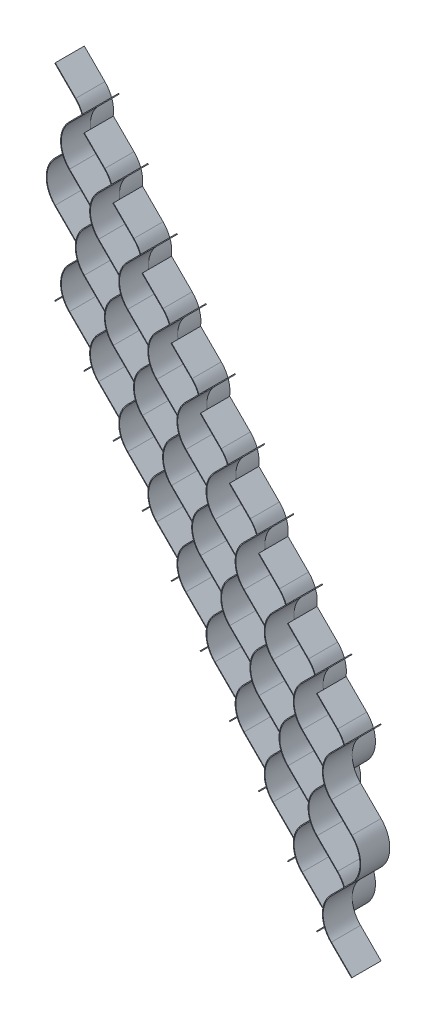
from build123d import *

# Parameters (mm, degrees)
LINEAR_AUSTRAGEN_D_NN1_DEPTH = 10
LINEAR_AUSTRAGEN_D_NN2_START = -2
LINEAR_AUSTRAGEN_D_NN2_DEPTH = 10
LINEARES_MUSTER2_COUNT       = 10
LINEARES_MUSTER2_PITCH       = 30.35


with BuildPart() as part:
    # Skizze3 → Linear-Austragen-D_nn1 (new body)
    with BuildSketch(Plane.XY):
        with BuildLine():
            Line((0, 0), (7.071067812, 7.071067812))
            ThreePointArc((7.071067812, 7.071067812), (10, 14.142135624), (7.071067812, 21.213203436))
            Line((7.071067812, 21.213203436), (0, 28.284271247))
            ThreePointArc((0, 28.284271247), (-2.928932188, 35.355339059), (0, 42.426406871))
            Line((0, 42.426406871), (7.071067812, 49.497474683))
            ThreePointArc((7.071067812, 49.497474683), (10, 56.568542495), (7.071067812, 63.639610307))
            Line((7.071067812, 63.639610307), (0, 70.710678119))
            Line((0, 70.710678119), (0.176776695, 70.887454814))
            Line((0.176776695, 70.887454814), (7.247844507, 63.816387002))
            ThreePointArc((7.247844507, 63.816387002), (10.25, 56.568542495), (7.247844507, 49.320697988))
            Line((7.247844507, 49.320697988), (0.176776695, 42.249630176))
            ThreePointArc((0.176776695, 42.249630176), (-2.678932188, 35.355339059), (0.176776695, 28.461047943))
            Line((0.176776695, 28.461047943), (7.247844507, 21.389980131))
            ThreePointArc((7.247844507, 21.389980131), (10.25, 14.142135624), (7.247844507, 6.894291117))
            Line((7.247844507, 6.894291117), (0.176776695, -0.176776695))
            Line((0.176776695, -0.176776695), (0, 0))
        make_face()
    extrude(amount=LINEAR_AUSTRAGEN_D_NN1_DEPTH)

    # Skizze6 → Linear-Austragen-D_nn2 (add)
    with BuildSketch(Plane.XY.offset(10).offset(LINEAR_AUSTRAGEN_D_NN2_START)):
        with BuildLine():
            Line((20, 0), (12.928932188, 7.071067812))
            ThreePointArc((12.928932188, 7.071067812), (10, 14.142135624), (12.928932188, 21.213203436))
            Line((12.928932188, 21.213203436), (20, 28.284271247))
            ThreePointArc((20, 28.284271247), (22.928932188, 35.355339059), (20, 42.426406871))
            Line((20, 42.426406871), (12.928932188, 49.497474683))
            ThreePointArc((12.928932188, 49.497474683), (10, 56.568542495), (12.928932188, 63.639610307))
            Line((12.928932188, 63.639610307), (20, 70.710678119))
            Line((20, 70.710678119), (20.176776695, 70.533901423))
            Line((20.176776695, 70.533901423), (13.105708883, 63.462833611))
            ThreePointArc((13.105708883, 63.462833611), (10.25, 56.568542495), (13.105708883, 49.674251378))
            Line((13.105708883, 49.674251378), (20.176776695, 42.603183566))
            ThreePointArc((20.176776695, 42.603183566), (23.178932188, 35.355339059), (20.176776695, 28.107494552))
            Line((20.176776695, 28.107494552), (13.105708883, 21.03642674))
            ThreePointArc((13.105708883, 21.03642674), (10.25, 14.142135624), (13.105708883, 7.247844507))
            Line((13.105708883, 7.247844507), (20.176776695, 0.176776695))
            Line((20.176776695, 0.176776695), (20, 0))
        make_face()
    extrude(amount=LINEAR_AUSTRAGEN_D_NN2_DEPTH)


with BuildPart() as lineares_muster2_1:
    # Lineares Muster2: pattern copy
    add(part.part.moved(Location(Vector(0.8524902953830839, 0, 0.5227430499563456) * (1 * LINEARES_MUSTER2_PITCH))))


with BuildPart() as lineares_muster2_2:
    # Lineares Muster2: pattern copy
    add(part.part.moved(Location(Vector(0.8524902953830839, 0, 0.5227430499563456) * (2 * LINEARES_MUSTER2_PITCH))))


with BuildPart() as lineares_muster2_3:
    # Lineares Muster2: pattern copy
    add(part.part.moved(Location(Vector(0.8524902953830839, 0, 0.5227430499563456) * (3 * LINEARES_MUSTER2_PITCH))))


with BuildPart() as lineares_muster2_4:
    # Lineares Muster2: pattern copy
    add(part.part.moved(Location(Vector(0.8524902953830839, 0, 0.5227430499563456) * (4 * LINEARES_MUSTER2_PITCH))))


with BuildPart() as lineares_muster2_5:
    # Lineares Muster2: pattern copy
    add(part.part.moved(Location(Vector(0.8524902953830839, 0, 0.5227430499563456) * (5 * LINEARES_MUSTER2_PITCH))))


with BuildPart() as lineares_muster2_6:
    # Lineares Muster2: pattern copy
    add(part.part.moved(Location(Vector(0.8524902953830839, 0, 0.5227430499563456) * (6 * LINEARES_MUSTER2_PITCH))))


with BuildPart() as lineares_muster2_7:
    # Lineares Muster2: pattern copy
    add(part.part.moved(Location(Vector(0.8524902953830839, 0, 0.5227430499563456) * (7 * LINEARES_MUSTER2_PITCH))))


with BuildPart() as lineares_muster2_8:
    # Lineares Muster2: pattern copy
    add(part.part.moved(Location(Vector(0.8524902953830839, 0, 0.5227430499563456) * (8 * LINEARES_MUSTER2_PITCH))))


with BuildPart() as lineares_muster2_9:
    # Lineares Muster2: pattern copy
    add(part.part.moved(Location(Vector(0.8524902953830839, 0, 0.5227430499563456) * (9 * LINEARES_MUSTER2_PITCH))))


solid = Compound([part.part, lineares_muster2_1.part, lineares_muster2_2.part, lineares_muster2_3.part, lineares_muster2_4.part, lineares_muster2_5.part, lineares_muster2_6.part, lineares_muster2_7.part, lineares_muster2_8.part, lineares_muster2_9.part])
